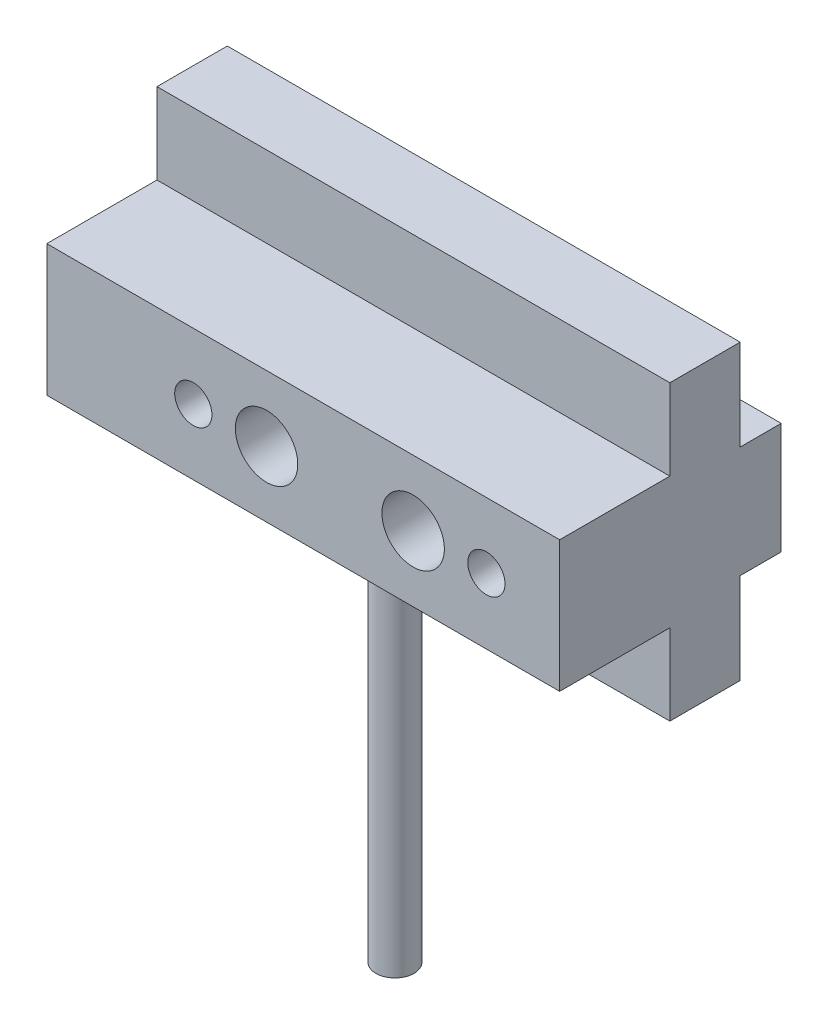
ISO-10303-21;
HEADER;
FILE_DESCRIPTION(('STEP AP214'),'2;1');
FILE_NAME('part.step','',(''),(''),'','','');
FILE_SCHEMA(('AUTOMOTIVE_DESIGN { 1 0 10303 214 1 1 1 1 }'));
ENDSEC;
DATA;
#1=APPLICATION_CONTEXT('core data for automotive mechanical design processes');
#2=APPLICATION_PROTOCOL_DEFINITION('international standard','automotive_design',2000,#1);
#3=PRODUCT_CONTEXT('',#1,'mechanical');
#4=PRODUCT('Part','Part','',(#3));
#5=PRODUCT_RELATED_PRODUCT_CATEGORY('part','',(#4));
#6=PRODUCT_DEFINITION_FORMATION('','',#4);
#7=PRODUCT_DEFINITION_CONTEXT('part definition',#1,'design');
#8=PRODUCT_DEFINITION('design','',#6,#7);
#9=PRODUCT_DEFINITION_SHAPE('','',#8);
#10=(LENGTH_UNIT() NAMED_UNIT(*) SI_UNIT(.MILLI.,.METRE.));
#11=(NAMED_UNIT(*) PLANE_ANGLE_UNIT() SI_UNIT($,.RADIAN.));
#12=(NAMED_UNIT(*) SI_UNIT($,.STERADIAN.) SOLID_ANGLE_UNIT());
#13=UNCERTAINTY_MEASURE_WITH_UNIT(LENGTH_MEASURE(1.E-05),#10,'distance_accuracy_value','');
#14=(GEOMETRIC_REPRESENTATION_CONTEXT(3) GLOBAL_UNCERTAINTY_ASSIGNED_CONTEXT((#13)) GLOBAL_UNIT_ASSIGNED_CONTEXT((#10,
#11,#12)) REPRESENTATION_CONTEXT('',''));
#15=CARTESIAN_POINT('',(0.,0.,0.));
#16=DIRECTION('',(0.,0.,1.));
#17=DIRECTION('',(1.,0.,0.));
#18=AXIS2_PLACEMENT_3D('',#15,#16,#17);
#19=CARTESIAN_POINT('',(11.1125,3.46709999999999,0.660400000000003));
#20=DIRECTION('',(0.,-1.,0.));
#21=DIRECTION('',(0.,0.,-1.));
#22=AXIS2_PLACEMENT_3D('',#19,#20,#21);
#23=PLANE('',#22);
#24=CARTESIAN_POINT('',(1.5875,3.46709999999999,3.048));
#25=DIRECTION('',(0.,-1.,0.));
#26=DIRECTION('',(0.,0.,-1.));
#27=AXIS2_PLACEMENT_3D('',#24,#25,#26);
#28=CIRCLE('',#27,0.4445);
#29=CARTESIAN_POINT('',(1.5875,3.46709999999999,2.6035));
#30=VERTEX_POINT('',#29);
#31=EDGE_CURVE('E292',#30,#30,#28,.T.);
#32=ORIENTED_EDGE('',*,*,#31,.T.);
#33=EDGE_LOOP('',(#32));
#34=FACE_BOUND('',#33,.T.);
#35=ADVANCED_FACE('F18',(#34),#23,.T.);
#36=CARTESIAN_POINT('',(1.5875,3.46709999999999,3.048));
#37=DIRECTION('',(0.,-1.,0.));
#38=DIRECTION('',(0.,0.,-1.));
#39=AXIS2_PLACEMENT_3D('',#36,#37,#38);
#40=CYLINDRICAL_SURFACE('',#39,0.4445);
#41=ORIENTED_EDGE('',*,*,#31,.F.);
#42=EDGE_LOOP('',(#41));
#43=FACE_BOUND('',#42,.T.);
#44=CARTESIAN_POINT('',(1.5875,-12.6619,3.048));
#45=DIRECTION('',(0.,-1.,0.));
#46=DIRECTION('',(0.,0.,-1.));
#47=AXIS2_PLACEMENT_3D('',#44,#45,#46);
#48=CIRCLE('',#47,0.4445);
#49=CARTESIAN_POINT('',(1.5875,-12.6619,2.6035));
#50=VERTEX_POINT('',#49);
#51=EDGE_CURVE('E150',#50,#50,#48,.T.);
#52=ORIENTED_EDGE('',*,*,#51,.T.);
#53=EDGE_LOOP('',(#52));
#54=FACE_BOUND('',#53,.T.);
#55=ADVANCED_FACE('F323',(#43,#54),#40,.F.);
#56=CARTESIAN_POINT('',(-7.30249999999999,6.43497454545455,2.81178));
#57=DIRECTION('',(1.,0.,0.));
#58=DIRECTION('',(0.,0.,-1.));
#59=AXIS2_PLACEMENT_3D('',#56,#57,#58);
#60=PLANE('',#59);
#61=CARTESIAN_POINT('',(-7.30249999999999,6.31189999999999,2.81178));
#62=DIRECTION('',(1.,0.,0.));
#63=DIRECTION('',(0.,0.,-1.));
#64=AXIS2_PLACEMENT_3D('',#61,#62,#63);
#65=CIRCLE('',#64,1.35382);
#66=CARTESIAN_POINT('',(-7.30249999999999,6.31189999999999,1.45796));
#67=VERTEX_POINT('',#66);
#68=EDGE_CURVE('E286',#67,#67,#65,.F.);
#69=ORIENTED_EDGE('',*,*,#68,.T.);
#70=EDGE_LOOP('',(#69));
#71=FACE_BOUND('',#70,.T.);
#72=ADVANCED_FACE('F327',(#71),#60,.F.);
#73=CARTESIAN_POINT('',(1.66254545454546,-12.6619,3.04800000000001));
#74=DIRECTION('',(0.,1.,0.));
#75=DIRECTION('',(0.,0.,1.));
#76=AXIS2_PLACEMENT_3D('',#73,#74,#75);
#77=PLANE('',#76);
#78=ORIENTED_EDGE('',*,*,#51,.F.);
#79=EDGE_LOOP('',(#78));
#80=FACE_BOUND('',#79,.T.);
#81=CARTESIAN_POINT('',(1.5875,-12.6619,3.048));
#82=DIRECTION('',(0.,-1.,0.));
#83=DIRECTION('',(0.,0.,-1.));
#84=AXIS2_PLACEMENT_3D('',#81,#82,#83);
#85=CIRCLE('',#84,0.8255);
#86=CARTESIAN_POINT('',(1.5875,-12.6619,2.2225));
#87=VERTEX_POINT('',#86);
#88=EDGE_CURVE('E282',#87,#87,#85,.F.);
#89=ORIENTED_EDGE('',*,*,#88,.F.);
#90=EDGE_LOOP('',(#89));
#91=FACE_BOUND('',#90,.T.);
#92=ADVANCED_FACE('F331',(#80,#91),#77,.F.);
#93=CARTESIAN_POINT('',(-4.7625,6.31189999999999,-4.8006));
#94=DIRECTION('',(-1.,0.,0.));
#95=DIRECTION('',(0.,0.,1.));
#96=AXIS2_PLACEMENT_3D('',#93,#94,#95);
#97=PLANE('',#96);
#98=DIRECTION('',(0.,1.,0.));
#99=VECTOR('',#98,1.);
#100=CARTESIAN_POINT('',(-4.7625,6.31189999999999,-5.43559999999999));
#101=LINE('',#100,#99);
#102=CARTESIAN_POINT('',(-4.7625,3.89889999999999,-5.43559999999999));
#103=VERTEX_POINT('',#102);
#104=CARTESIAN_POINT('',(-4.7625,8.72489999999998,-5.43559999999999));
#105=VERTEX_POINT('',#104);
#106=EDGE_CURVE('E140',#103,#105,#101,.T.);
#107=ORIENTED_EDGE('',*,*,#106,.T.);
#108=DIRECTION('',(0.,0.,1.));
#109=VECTOR('',#108,1.);
#110=CARTESIAN_POINT('',(-4.7625,8.72489999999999,-4.1656));
#111=LINE('',#110,#109);
#112=CARTESIAN_POINT('',(-4.7625,8.72489999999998,-4.1656));
#113=VERTEX_POINT('',#112);
#114=EDGE_CURVE('E185',#113,#105,#111,.F.);
#115=ORIENTED_EDGE('',*,*,#114,.F.);
#116=DIRECTION('',(0.,1.,0.));
#117=VECTOR('',#116,1.);
#118=CARTESIAN_POINT('',(-4.7625,3.8989,-4.1656));
#119=LINE('',#118,#117);
#120=CARTESIAN_POINT('',(-4.7625,3.8989,-4.1656));
#121=VERTEX_POINT('',#120);
#122=EDGE_CURVE('E165',#121,#113,#119,.T.);
#123=ORIENTED_EDGE('',*,*,#122,.F.);
#124=DIRECTION('',(0.,0.,-1.));
#125=VECTOR('',#124,1.);
#126=CARTESIAN_POINT('',(-4.7625,3.8989,-2.38759999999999));
#127=LINE('',#126,#125);
#128=EDGE_CURVE('E157',#103,#121,#127,.F.);
#129=ORIENTED_EDGE('',*,*,#128,.F.);
#130=EDGE_LOOP('',(#107,#115,#123,#129));
#131=FACE_BOUND('',#130,.T.);
#132=ADVANCED_FACE('F164',(#131),#97,.F.);
#133=CARTESIAN_POINT('',(-5.3975,6.31189999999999,-5.43559999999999));
#134=DIRECTION('',(0.,0.,1.));
#135=DIRECTION('',(1.,0.,0.));
#136=AXIS2_PLACEMENT_3D('',#133,#134,#135);
#137=PLANE('',#136);
#138=DIRECTION('',(1.,0.,0.));
#139=VECTOR('',#138,1.);
#140=CARTESIAN_POINT('',(11.1125,3.8989,-5.43559999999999));
#141=LINE('',#140,#139);
#142=CARTESIAN_POINT('',(-6.03249999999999,3.89889999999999,-5.43559999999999));
#143=VERTEX_POINT('',#142);
#144=EDGE_CURVE('E144',#143,#103,#141,.T.);
#145=ORIENTED_EDGE('',*,*,#144,.F.);
#146=DIRECTION('',(0.,1.,0.));
#147=VECTOR('',#146,1.);
#148=CARTESIAN_POINT('',(-6.03249999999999,6.31189999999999,-5.43559999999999));
#149=LINE('',#148,#147);
#150=CARTESIAN_POINT('',(-6.03249999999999,8.72489999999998,-5.43559999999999));
#151=VERTEX_POINT('',#150);
#152=EDGE_CURVE('E149',#143,#151,#149,.T.);
#153=ORIENTED_EDGE('',*,*,#152,.T.);
#154=DIRECTION('',(1.,0.,0.));
#155=VECTOR('',#154,1.);
#156=CARTESIAN_POINT('',(11.1125,8.72489999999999,-5.43559999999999));
#157=LINE('',#156,#155);
#158=EDGE_CURVE('E145',#105,#151,#157,.F.);
#159=ORIENTED_EDGE('',*,*,#158,.F.);
#160=ORIENTED_EDGE('',*,*,#106,.F.);
#161=EDGE_LOOP('',(#145,#153,#159,#160));
#162=FACE_BOUND('',#161,.T.);
#163=ADVANCED_FACE('F142',(#162),#137,.F.);
#164=CARTESIAN_POINT('',(-6.03249999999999,6.31189999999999,-4.8006));
#165=DIRECTION('',(1.,0.,0.));
#166=DIRECTION('',(0.,0.,-1.));
#167=AXIS2_PLACEMENT_3D('',#164,#165,#166);
#168=PLANE('',#167);
#169=ORIENTED_EDGE('',*,*,#152,.F.);
#170=DIRECTION('',(0.,0.,-1.));
#171=VECTOR('',#170,1.);
#172=CARTESIAN_POINT('',(-6.03249999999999,3.8989,-2.38759999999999));
#173=LINE('',#172,#171);
#174=CARTESIAN_POINT('',(-6.03249999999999,3.89889999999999,-4.1656));
#175=VERTEX_POINT('',#174);
#176=EDGE_CURVE('E161',#175,#143,#173,.T.);
#177=ORIENTED_EDGE('',*,*,#176,.F.);
#178=DIRECTION('',(0.,1.,0.));
#179=VECTOR('',#178,1.);
#180=CARTESIAN_POINT('',(-6.03249999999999,3.8989,-4.1656));
#181=LINE('',#180,#179);
#182=CARTESIAN_POINT('',(-6.03249999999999,8.72489999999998,-4.1656));
#183=VERTEX_POINT('',#182);
#184=EDGE_CURVE('E289',#183,#175,#181,.F.);
#185=ORIENTED_EDGE('',*,*,#184,.F.);
#186=DIRECTION('',(0.,0.,1.));
#187=VECTOR('',#186,1.);
#188=CARTESIAN_POINT('',(-6.03249999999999,8.72489999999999,-4.1656));
#189=LINE('',#188,#187);
#190=EDGE_CURVE('E182',#151,#183,#189,.T.);
#191=ORIENTED_EDGE('',*,*,#190,.F.);
#192=EDGE_LOOP('',(#169,#177,#185,#191));
#193=FACE_BOUND('',#192,.T.);
#194=ADVANCED_FACE('F340',(#193),#168,.F.);
#195=CARTESIAN_POINT('',(11.1125,3.8989,-4.1656));
#196=DIRECTION('',(0.,0.,-1.));
#197=DIRECTION('',(-1.,0.,0.));
#198=AXIS2_PLACEMENT_3D('',#195,#196,#197);
#199=PLANE('',#198);
#200=DIRECTION('',(0.,1.,0.));
#201=VECTOR('',#200,1.);
#202=CARTESIAN_POINT('',(-11.1125,6.3119,-4.1656));
#203=LINE('',#202,#201);
#204=CARTESIAN_POINT('',(-11.1125,8.72489999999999,-4.1656));
#205=VERTEX_POINT('',#204);
#206=CARTESIAN_POINT('',(-11.1125,3.8989,-4.1656));
#207=VERTEX_POINT('',#206);
#208=EDGE_CURVE('E213',#205,#207,#203,.F.);
#209=ORIENTED_EDGE('',*,*,#208,.F.);
#210=DIRECTION('',(1.,0.,0.));
#211=VECTOR('',#210,1.);
#212=CARTESIAN_POINT('',(11.1125,8.72489999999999,-4.1656));
#213=LINE('',#212,#211);
#214=EDGE_CURVE('E179',#183,#205,#213,.F.);
#215=ORIENTED_EDGE('',*,*,#214,.F.);
#216=ORIENTED_EDGE('',*,*,#184,.T.);
#217=DIRECTION('',(1.,0.,0.));
#218=VECTOR('',#217,1.);
#219=CARTESIAN_POINT('',(11.1125,3.8989,-4.1656));
#220=LINE('',#219,#218);
#221=EDGE_CURVE('E172',#207,#175,#220,.T.);
#222=ORIENTED_EDGE('',*,*,#221,.F.);
#223=EDGE_LOOP('',(#209,#215,#216,#222));
#224=FACE_BOUND('',#223,.T.);
#225=ADVANCED_FACE('F343',(#224),#199,.T.);
#226=CARTESIAN_POINT('',(-11.1125,6.31189999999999,2.81178));
#227=DIRECTION('',(1.,0.,0.));
#228=DIRECTION('',(0.,0.,-1.));
#229=AXIS2_PLACEMENT_3D('',#226,#227,#228);
#230=CYLINDRICAL_SURFACE('',#229,1.35382);
#231=CARTESIAN_POINT('',(-11.1125,6.31189999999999,2.81178));
#232=DIRECTION('',(1.,0.,0.));
#233=DIRECTION('',(0.,0.,-1.));
#234=AXIS2_PLACEMENT_3D('',#231,#232,#233);
#235=CIRCLE('',#234,1.35382);
#236=CARTESIAN_POINT('',(-11.1125,6.31189999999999,1.45796));
#237=VERTEX_POINT('',#236);
#238=EDGE_CURVE('E198',#237,#237,#235,.T.);
#239=ORIENTED_EDGE('',*,*,#238,.F.);
#240=EDGE_LOOP('',(#239));
#241=FACE_BOUND('',#240,.T.);
#242=ORIENTED_EDGE('',*,*,#68,.F.);
#243=EDGE_LOOP('',(#242));
#244=FACE_BOUND('',#243,.T.);
#245=ADVANCED_FACE('F347',(#241,#244),#230,.F.);
#246=CARTESIAN_POINT('',(1.5875,3.4671,3.048));
#247=DIRECTION('',(0.,-1.,0.));
#248=DIRECTION('',(0.,0.,-1.));
#249=AXIS2_PLACEMENT_3D('',#246,#247,#248);
#250=CYLINDRICAL_SURFACE('',#249,0.8255);
#251=CARTESIAN_POINT('',(1.5875,3.4671,3.048));
#252=DIRECTION('',(0.,-1.,0.));
#253=DIRECTION('',(0.,0.,-1.));
#254=AXIS2_PLACEMENT_3D('',#251,#252,#253);
#255=CIRCLE('',#254,0.8255);
#256=CARTESIAN_POINT('',(1.5875,3.4671,2.2225));
#257=VERTEX_POINT('',#256);
#258=EDGE_CURVE('E222',#257,#257,#255,.F.);
#259=ORIENTED_EDGE('',*,*,#258,.F.);
#260=EDGE_LOOP('',(#259));
#261=FACE_BOUND('',#260,.T.);
#262=ORIENTED_EDGE('',*,*,#88,.T.);
#263=EDGE_LOOP('',(#262));
#264=FACE_BOUND('',#263,.T.);
#265=ADVANCED_FACE('F351',(#261,#264),#250,.T.);
#266=CARTESIAN_POINT('',(11.1125,12.6619,0.660400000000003));
#267=DIRECTION('',(0.,0.,1.));
#268=DIRECTION('',(1.,0.,0.));
#269=AXIS2_PLACEMENT_3D('',#266,#267,#268);
#270=PLANE('',#269);
#271=DIRECTION('',(0.,1.,0.));
#272=VECTOR('',#271,1.);
#273=CARTESIAN_POINT('',(11.1125,9.1567,0.660400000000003));
#274=LINE('',#273,#272);
#275=CARTESIAN_POINT('',(11.1125,3.46709999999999,0.660400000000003));
#276=VERTEX_POINT('',#275);
#277=CARTESIAN_POINT('',(11.1125,-0.0381000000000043,0.660400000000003));
#278=VERTEX_POINT('',#277);
#279=EDGE_CURVE('E241',#276,#278,#274,.F.);
#280=ORIENTED_EDGE('',*,*,#279,.F.);
#281=DIRECTION('',(1.,0.,0.));
#282=VECTOR('',#281,1.);
#283=CARTESIAN_POINT('',(11.1125,3.46709999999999,0.660400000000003));
#284=LINE('',#283,#282);
#285=CARTESIAN_POINT('',(-11.1125,3.46709999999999,0.660400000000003));
#286=VERTEX_POINT('',#285);
#287=EDGE_CURVE('E220',#286,#276,#284,.T.);
#288=ORIENTED_EDGE('',*,*,#287,.F.);
#289=DIRECTION('',(0.,1.,0.));
#290=VECTOR('',#289,1.);
#291=CARTESIAN_POINT('',(-11.1125,6.3119,0.660400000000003));
#292=LINE('',#291,#290);
#293=CARTESIAN_POINT('',(-11.1125,-0.038100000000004,0.660400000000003));
#294=VERTEX_POINT('',#293);
#295=EDGE_CURVE('E202',#294,#286,#292,.T.);
#296=ORIENTED_EDGE('',*,*,#295,.F.);
#297=DIRECTION('',(1.,0.,0.));
#298=VECTOR('',#297,1.);
#299=CARTESIAN_POINT('',(11.1125,-0.038100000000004,0.660400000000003));
#300=LINE('',#299,#298);
#301=EDGE_CURVE('E285',#278,#294,#300,.F.);
#302=ORIENTED_EDGE('',*,*,#301,.F.);
#303=EDGE_LOOP('',(#280,#288,#296,#302));
#304=FACE_BOUND('',#303,.T.);
#305=ADVANCED_FACE('F355',(#304),#270,.T.);
#306=CARTESIAN_POINT('',(11.1125,-0.038100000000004,0.660400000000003));
#307=DIRECTION('',(0.,-1.,0.));
#308=DIRECTION('',(0.,0.,-1.));
#309=AXIS2_PLACEMENT_3D('',#306,#307,#308);
#310=PLANE('',#309);
#311=DIRECTION('',(0.,0.,-1.));
#312=VECTOR('',#311,1.);
#313=CARTESIAN_POINT('',(11.1125,-0.0381000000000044,0.660400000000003));
#314=LINE('',#313,#312);
#315=CARTESIAN_POINT('',(11.1125,-0.0381000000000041,-2.38759999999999));
#316=VERTEX_POINT('',#315);
#317=EDGE_CURVE('E239',#278,#316,#314,.T.);
#318=ORIENTED_EDGE('',*,*,#317,.F.);
#319=ORIENTED_EDGE('',*,*,#301,.T.);
#320=DIRECTION('',(0.,0.,1.));
#321=VECTOR('',#320,1.);
#322=CARTESIAN_POINT('',(-11.1125,-0.0381000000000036,0.198339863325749));
#323=LINE('',#322,#321);
#324=CARTESIAN_POINT('',(-11.1125,-0.0381000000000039,-2.38759999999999));
#325=VERTEX_POINT('',#324);
#326=EDGE_CURVE('E204',#325,#294,#323,.T.);
#327=ORIENTED_EDGE('',*,*,#326,.F.);
#328=DIRECTION('',(-1.,0.,0.));
#329=VECTOR('',#328,1.);
#330=CARTESIAN_POINT('',(11.1125,-0.038100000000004,-2.38759999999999));
#331=LINE('',#330,#329);
#332=EDGE_CURVE('E174',#316,#325,#331,.T.);
#333=ORIENTED_EDGE('',*,*,#332,.F.);
#334=EDGE_LOOP('',(#318,#319,#327,#333));
#335=FACE_BOUND('',#334,.T.);
#336=ADVANCED_FACE('F359',(#335),#310,.T.);
#337=CARTESIAN_POINT('',(11.1125,-0.038100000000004,-2.38759999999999));
#338=DIRECTION('',(0.,0.,-1.));
#339=DIRECTION('',(-1.,0.,0.));
#340=AXIS2_PLACEMENT_3D('',#337,#338,#339);
#341=PLANE('',#340);
#342=DIRECTION('',(0.,1.,0.));
#343=VECTOR('',#342,1.);
#344=CARTESIAN_POINT('',(11.1125,9.1567,-2.38759999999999));
#345=LINE('',#344,#343);
#346=CARTESIAN_POINT('',(11.1125,3.89889999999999,-2.38759999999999));
#347=VERTEX_POINT('',#346);
#348=EDGE_CURVE('E237',#316,#347,#345,.T.);
#349=ORIENTED_EDGE('',*,*,#348,.F.);
#350=ORIENTED_EDGE('',*,*,#332,.T.);
#351=DIRECTION('',(0.,1.,0.));
#352=VECTOR('',#351,1.);
#353=CARTESIAN_POINT('',(-11.1125,6.3119,-2.38759999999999));
#354=LINE('',#353,#352);
#355=CARTESIAN_POINT('',(-11.1125,3.89889999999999,-2.38759999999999));
#356=VERTEX_POINT('',#355);
#357=EDGE_CURVE('E207',#356,#325,#354,.F.);
#358=ORIENTED_EDGE('',*,*,#357,.F.);
#359=DIRECTION('',(1.,0.,0.));
#360=VECTOR('',#359,1.);
#361=CARTESIAN_POINT('',(11.1125,3.8989,-2.38759999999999));
#362=LINE('',#361,#360);
#363=EDGE_CURVE('E166',#347,#356,#362,.F.);
#364=ORIENTED_EDGE('',*,*,#363,.F.);
#365=EDGE_LOOP('',(#349,#350,#358,#364));
#366=FACE_BOUND('',#365,.T.);
#367=ADVANCED_FACE('F363',(#366),#341,.T.);
#368=CARTESIAN_POINT('',(11.1125,3.8989,-2.38759999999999));
#369=DIRECTION('',(0.,-1.,0.));
#370=DIRECTION('',(0.,0.,-1.));
#371=AXIS2_PLACEMENT_3D('',#368,#369,#370);
#372=PLANE('',#371);
#373=DIRECTION('',(0.,0.,-1.));
#374=VECTOR('',#373,1.);
#375=CARTESIAN_POINT('',(11.1125,3.8989,0.660400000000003));
#376=LINE('',#375,#374);
#377=CARTESIAN_POINT('',(11.1125,3.8989,-4.1656));
#378=VERTEX_POINT('',#377);
#379=EDGE_CURVE('E235',#347,#378,#376,.T.);
#380=ORIENTED_EDGE('',*,*,#379,.F.);
#381=ORIENTED_EDGE('',*,*,#363,.T.);
#382=DIRECTION('',(0.,0.,1.));
#383=VECTOR('',#382,1.);
#384=CARTESIAN_POINT('',(-11.1125,3.8989,0.198339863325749));
#385=LINE('',#384,#383);
#386=EDGE_CURVE('E210',#207,#356,#385,.T.);
#387=ORIENTED_EDGE('',*,*,#386,.F.);
#388=ORIENTED_EDGE('',*,*,#221,.T.);
#389=ORIENTED_EDGE('',*,*,#176,.T.);
#390=ORIENTED_EDGE('',*,*,#144,.T.);
#391=ORIENTED_EDGE('',*,*,#128,.T.);
#392=DIRECTION('',(-1.,0.,0.));
#393=VECTOR('',#392,1.);
#394=CARTESIAN_POINT('',(11.1125,3.8989,-4.1656));
#395=LINE('',#394,#393);
#396=EDGE_CURVE('E175',#378,#121,#395,.T.);
#397=ORIENTED_EDGE('',*,*,#396,.F.);
#398=EDGE_LOOP('',(#380,#381,#387,#388,#389,#390,#391,#397));
#399=FACE_BOUND('',#398,.T.);
#400=ADVANCED_FACE('F155',(#399),#372,.T.);
#401=CARTESIAN_POINT('',(11.1125,3.8989,-4.1656));
#402=DIRECTION('',(0.,0.,-1.));
#403=DIRECTION('',(-1.,0.,0.));
#404=AXIS2_PLACEMENT_3D('',#401,#402,#403);
#405=PLANE('',#404);
#406=DIRECTION('',(0.,1.,0.));
#407=VECTOR('',#406,1.);
#408=CARTESIAN_POINT('',(11.1125,9.1567,-4.1656));
#409=LINE('',#408,#407);
#410=CARTESIAN_POINT('',(11.1125,8.72489999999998,-4.1656));
#411=VERTEX_POINT('',#410);
#412=EDGE_CURVE('E233',#378,#411,#409,.T.);
#413=ORIENTED_EDGE('',*,*,#412,.F.);
#414=ORIENTED_EDGE('',*,*,#396,.T.);
#415=ORIENTED_EDGE('',*,*,#122,.T.);
#416=DIRECTION('',(1.,0.,0.));
#417=VECTOR('',#416,1.);
#418=CARTESIAN_POINT('',(11.1125,8.72489999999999,-4.1656));
#419=LINE('',#418,#417);
#420=EDGE_CURVE('E177',#411,#113,#419,.F.);
#421=ORIENTED_EDGE('',*,*,#420,.F.);
#422=EDGE_LOOP('',(#413,#414,#415,#421));
#423=FACE_BOUND('',#422,.T.);
#424=ADVANCED_FACE('F370',(#423),#405,.T.);
#425=CARTESIAN_POINT('',(11.1125,8.72489999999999,-4.1656));
#426=DIRECTION('',(0.,1.,0.));
#427=DIRECTION('',(0.,0.,1.));
#428=AXIS2_PLACEMENT_3D('',#425,#426,#427);
#429=PLANE('',#428);
#430=ORIENTED_EDGE('',*,*,#190,.T.);
#431=ORIENTED_EDGE('',*,*,#214,.T.);
#432=DIRECTION('',(0.,0.,1.));
#433=VECTOR('',#432,1.);
#434=CARTESIAN_POINT('',(-11.1125,8.72489999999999,0.198339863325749));
#435=LINE('',#434,#433);
#436=CARTESIAN_POINT('',(-11.1125,8.72489999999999,-2.38759999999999));
#437=VERTEX_POINT('',#436);
#438=EDGE_CURVE('E215',#437,#205,#435,.F.);
#439=ORIENTED_EDGE('',*,*,#438,.F.);
#440=DIRECTION('',(-1.,0.,0.));
#441=VECTOR('',#440,1.);
#442=CARTESIAN_POINT('',(11.1125,8.72489999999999,-2.38759999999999));
#443=LINE('',#442,#441);
#444=CARTESIAN_POINT('',(11.1125,8.72489999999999,-2.38759999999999));
#445=VERTEX_POINT('',#444);
#446=EDGE_CURVE('E181',#445,#437,#443,.T.);
#447=ORIENTED_EDGE('',*,*,#446,.F.);
#448=DIRECTION('',(0.,0.,-1.));
#449=VECTOR('',#448,1.);
#450=CARTESIAN_POINT('',(11.1125,8.72489999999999,0.660400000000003));
#451=LINE('',#450,#449);
#452=EDGE_CURVE('E231',#411,#445,#451,.F.);
#453=ORIENTED_EDGE('',*,*,#452,.F.);
#454=ORIENTED_EDGE('',*,*,#420,.T.);
#455=ORIENTED_EDGE('',*,*,#114,.T.);
#456=ORIENTED_EDGE('',*,*,#158,.T.);
#457=EDGE_LOOP('',(#430,#431,#439,#447,#453,#454,#455,#456));
#458=FACE_BOUND('',#457,.T.);
#459=ADVANCED_FACE('F373',(#458),#429,.T.);
#460=CARTESIAN_POINT('',(11.1125,8.72489999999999,-2.38759999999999));
#461=DIRECTION('',(0.,0.,-1.));
#462=DIRECTION('',(-1.,0.,0.));
#463=AXIS2_PLACEMENT_3D('',#460,#461,#462);
#464=PLANE('',#463);
#465=DIRECTION('',(0.,1.,0.));
#466=VECTOR('',#465,1.);
#467=CARTESIAN_POINT('',(11.1125,9.1567,-2.38759999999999));
#468=LINE('',#467,#466);
#469=CARTESIAN_POINT('',(11.1125,12.6619,-2.38759999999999));
#470=VERTEX_POINT('',#469);
#471=EDGE_CURVE('E229',#445,#470,#468,.T.);
#472=ORIENTED_EDGE('',*,*,#471,.F.);
#473=ORIENTED_EDGE('',*,*,#446,.T.);
#474=DIRECTION('',(0.,1.,0.));
#475=VECTOR('',#474,1.);
#476=CARTESIAN_POINT('',(-11.1125,6.3119,-2.38759999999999));
#477=LINE('',#476,#475);
#478=CARTESIAN_POINT('',(-11.1125,12.6619,-2.38759999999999));
#479=VERTEX_POINT('',#478);
#480=EDGE_CURVE('E194',#479,#437,#477,.F.);
#481=ORIENTED_EDGE('',*,*,#480,.F.);
#482=DIRECTION('',(1.,0.,0.));
#483=VECTOR('',#482,1.);
#484=CARTESIAN_POINT('',(11.1125,12.6619,-2.38759999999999));
#485=LINE('',#484,#483);
#486=EDGE_CURVE('E190',#470,#479,#485,.F.);
#487=ORIENTED_EDGE('',*,*,#486,.F.);
#488=EDGE_LOOP('',(#472,#473,#481,#487));
#489=FACE_BOUND('',#488,.T.);
#490=ADVANCED_FACE('F377',(#489),#464,.T.);
#491=CARTESIAN_POINT('',(11.1125,12.6619,-2.38759999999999));
#492=DIRECTION('',(0.,1.,0.));
#493=DIRECTION('',(0.,0.,1.));
#494=AXIS2_PLACEMENT_3D('',#491,#492,#493);
#495=PLANE('',#494);
#496=DIRECTION('',(0.,0.,-1.));
#497=VECTOR('',#496,1.);
#498=CARTESIAN_POINT('',(11.1125,12.6619,0.660400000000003));
#499=LINE('',#498,#497);
#500=CARTESIAN_POINT('',(11.1125,12.6619,0.660400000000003));
#501=VERTEX_POINT('',#500);
#502=EDGE_CURVE('E227',#470,#501,#499,.F.);
#503=ORIENTED_EDGE('',*,*,#502,.F.);
#504=ORIENTED_EDGE('',*,*,#486,.T.);
#505=DIRECTION('',(0.,0.,1.));
#506=VECTOR('',#505,1.);
#507=CARTESIAN_POINT('',(-11.1125,12.6619,0.198339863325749));
#508=LINE('',#507,#506);
#509=CARTESIAN_POINT('',(-11.1125,12.6619,0.660400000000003));
#510=VERTEX_POINT('',#509);
#511=EDGE_CURVE('E195',#510,#479,#508,.F.);
#512=ORIENTED_EDGE('',*,*,#511,.F.);
#513=DIRECTION('',(1.,0.,0.));
#514=VECTOR('',#513,1.);
#515=CARTESIAN_POINT('',(11.1125,12.6619,0.660400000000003));
#516=LINE('',#515,#514);
#517=EDGE_CURVE('E192',#501,#510,#516,.F.);
#518=ORIENTED_EDGE('',*,*,#517,.F.);
#519=EDGE_LOOP('',(#503,#504,#512,#518));
#520=FACE_BOUND('',#519,.T.);
#521=ADVANCED_FACE('F381',(#520),#495,.T.);
#522=CARTESIAN_POINT('',(11.1125,12.6619,0.660400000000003));
#523=DIRECTION('',(0.,0.,1.));
#524=DIRECTION('',(1.,0.,0.));
#525=AXIS2_PLACEMENT_3D('',#522,#523,#524);
#526=PLANE('',#525);
#527=DIRECTION('',(0.,1.,0.));
#528=VECTOR('',#527,1.);
#529=CARTESIAN_POINT('',(11.1125,9.1567,0.660400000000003));
#530=LINE('',#529,#528);
#531=CARTESIAN_POINT('',(11.1125,9.1567,0.660400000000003));
#532=VERTEX_POINT('',#531);
#533=EDGE_CURVE('E56',#501,#532,#530,.F.);
#534=ORIENTED_EDGE('',*,*,#533,.F.);
#535=ORIENTED_EDGE('',*,*,#517,.T.);
#536=DIRECTION('',(0.,1.,0.));
#537=VECTOR('',#536,1.);
#538=CARTESIAN_POINT('',(-11.1125,6.3119,0.660400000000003));
#539=LINE('',#538,#537);
#540=CARTESIAN_POINT('',(-11.1125,9.15669999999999,0.660400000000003));
#541=VERTEX_POINT('',#540);
#542=EDGE_CURVE('E199',#541,#510,#539,.T.);
#543=ORIENTED_EDGE('',*,*,#542,.F.);
#544=DIRECTION('',(1.,0.,0.));
#545=VECTOR('',#544,1.);
#546=CARTESIAN_POINT('',(-11.2395,9.1567,0.660400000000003));
#547=LINE('',#546,#545);
#548=EDGE_CURVE('E246',#532,#541,#547,.F.);
#549=ORIENTED_EDGE('',*,*,#548,.F.);
#550=EDGE_LOOP('',(#534,#535,#543,#549));
#551=FACE_BOUND('',#550,.T.);
#552=ADVANCED_FACE('F385',(#551),#526,.T.);
#553=CARTESIAN_POINT('',(-4.83581363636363,6.3119,2.1336));
#554=DIRECTION('',(0.,0.,1.));
#555=DIRECTION('',(1.,0.,0.));
#556=AXIS2_PLACEMENT_3D('',#553,#554,#555);
#557=PLANE('',#556);
#558=CARTESIAN_POINT('',(-4.7625,6.3119,2.1336));
#559=DIRECTION('',(0.,0.,1.));
#560=DIRECTION('',(1.,0.,0.));
#561=AXIS2_PLACEMENT_3D('',#558,#559,#560);
#562=CIRCLE('',#561,0.80645);
#563=CARTESIAN_POINT('',(-3.95605,6.3119,2.1336));
#564=VERTEX_POINT('',#563);
#565=EDGE_CURVE('E248',#564,#564,#562,.T.);
#566=ORIENTED_EDGE('',*,*,#565,.T.);
#567=EDGE_LOOP('',(#566));
#568=FACE_BOUND('',#567,.T.);
#569=ADVANCED_FACE('F389',(#568),#557,.T.);
#570=CARTESIAN_POINT('',(-1.71045909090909,6.3119,0.863599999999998));
#571=DIRECTION('',(0.,0.,1.));
#572=DIRECTION('',(1.,0.,0.));
#573=AXIS2_PLACEMENT_3D('',#570,#571,#572);
#574=PLANE('',#573);
#575=CARTESIAN_POINT('',(-1.5875,6.3119,0.863599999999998));
#576=DIRECTION('',(0.,0.,-1.));
#577=DIRECTION('',(-1.,0.,0.));
#578=AXIS2_PLACEMENT_3D('',#575,#576,#577);
#579=CIRCLE('',#578,1.35255);
#580=CARTESIAN_POINT('',(-2.94005,6.3119,0.863599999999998));
#581=VERTEX_POINT('',#580);
#582=EDGE_CURVE('E273',#581,#581,#579,.F.);
#583=ORIENTED_EDGE('',*,*,#582,.T.);
#584=EDGE_LOOP('',(#583));
#585=FACE_BOUND('',#584,.T.);
#586=ADVANCED_FACE('F393',(#585),#574,.T.);
#587=CARTESIAN_POINT('',(4.6395409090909,6.3119,0.863599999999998));
#588=DIRECTION('',(0.,0.,1.));
#589=DIRECTION('',(1.,0.,0.));
#590=AXIS2_PLACEMENT_3D('',#587,#588,#589);
#591=PLANE('',#590);
#592=CARTESIAN_POINT('',(4.7625,6.3119,0.863599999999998));
#593=DIRECTION('',(0.,0.,-1.));
#594=DIRECTION('',(-1.,0.,0.));
#595=AXIS2_PLACEMENT_3D('',#592,#593,#594);
#596=CIRCLE('',#595,1.35255);
#597=CARTESIAN_POINT('',(3.40995,6.3119,0.863599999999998));
#598=VERTEX_POINT('',#597);
#599=EDGE_CURVE('E259',#598,#598,#596,.F.);
#600=ORIENTED_EDGE('',*,*,#599,.T.);
#601=EDGE_LOOP('',(#600));
#602=FACE_BOUND('',#601,.T.);
#603=ADVANCED_FACE('F397',(#602),#591,.T.);
#604=CARTESIAN_POINT('',(-11.1125,6.3119,0.198339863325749));
#605=DIRECTION('',(-1.,0.,0.));
#606=DIRECTION('',(0.,0.,1.));
#607=AXIS2_PLACEMENT_3D('',#604,#605,#606);
#608=PLANE('',#607);
#609=ORIENTED_EDGE('',*,*,#238,.T.);
#610=EDGE_LOOP('',(#609));
#611=FACE_BOUND('',#610,.T.);
#612=ORIENTED_EDGE('',*,*,#542,.T.);
#613=ORIENTED_EDGE('',*,*,#511,.T.);
#614=ORIENTED_EDGE('',*,*,#480,.T.);
#615=ORIENTED_EDGE('',*,*,#438,.T.);
#616=ORIENTED_EDGE('',*,*,#208,.T.);
#617=ORIENTED_EDGE('',*,*,#386,.T.);
#618=ORIENTED_EDGE('',*,*,#357,.T.);
#619=ORIENTED_EDGE('',*,*,#326,.T.);
#620=ORIENTED_EDGE('',*,*,#295,.T.);
#621=DIRECTION('',(0.,0.,-1.));
#622=VECTOR('',#621,1.);
#623=CARTESIAN_POINT('',(-11.1125,3.46709999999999,0.660400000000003));
#624=LINE('',#623,#622);
#625=CARTESIAN_POINT('',(-11.1125,3.46709999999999,5.4356));
#626=VERTEX_POINT('',#625);
#627=EDGE_CURVE('E223',#626,#286,#624,.T.);
#628=ORIENTED_EDGE('',*,*,#627,.F.);
#629=DIRECTION('',(0.,1.,0.));
#630=VECTOR('',#629,1.);
#631=CARTESIAN_POINT('',(-11.1125,6.3119,5.4356));
#632=LINE('',#631,#630);
#633=CARTESIAN_POINT('',(-11.1125,9.15669999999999,5.4356));
#634=VERTEX_POINT('',#633);
#635=EDGE_CURVE('E258',#634,#626,#632,.F.);
#636=ORIENTED_EDGE('',*,*,#635,.F.);
#637=DIRECTION('',(0.,0.,1.));
#638=VECTOR('',#637,1.);
#639=CARTESIAN_POINT('',(-11.1125,9.1567,0.660400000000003));
#640=LINE('',#639,#638);
#641=EDGE_CURVE('E50',#541,#634,#640,.T.);
#642=ORIENTED_EDGE('',*,*,#641,.F.);
#643=EDGE_LOOP('',(#612,#613,#614,#615,#616,#617,#618,#619,#620,#628,#636,#642));
#644=FACE_BOUND('',#643,.T.);
#645=ADVANCED_FACE('F401',(#611,#644),#608,.T.);
#646=CARTESIAN_POINT('',(11.1125,3.46709999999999,0.660400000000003));
#647=DIRECTION('',(0.,-1.,0.));
#648=DIRECTION('',(0.,0.,-1.));
#649=AXIS2_PLACEMENT_3D('',#646,#647,#648);
#650=PLANE('',#649);
#651=ORIENTED_EDGE('',*,*,#258,.T.);
#652=EDGE_LOOP('',(#651));
#653=FACE_BOUND('',#652,.T.);
#654=DIRECTION('',(0.,0.,-1.));
#655=VECTOR('',#654,1.);
#656=CARTESIAN_POINT('',(11.1125,3.46709999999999,0.660400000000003));
#657=LINE('',#656,#655);
#658=CARTESIAN_POINT('',(11.1125,3.46709999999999,5.4356));
#659=VERTEX_POINT('',#658);
#660=EDGE_CURVE('E243',#659,#276,#657,.T.);
#661=ORIENTED_EDGE('',*,*,#660,.F.);
#662=DIRECTION('',(1.,0.,0.));
#663=VECTOR('',#662,1.);
#664=CARTESIAN_POINT('',(-0.063499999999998,3.46709999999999,5.4356));
#665=LINE('',#664,#663);
#666=EDGE_CURVE('E256',#626,#659,#665,.T.);
#667=ORIENTED_EDGE('',*,*,#666,.F.);
#668=ORIENTED_EDGE('',*,*,#627,.T.);
#669=ORIENTED_EDGE('',*,*,#287,.T.);
#670=EDGE_LOOP('',(#661,#667,#668,#669));
#671=FACE_BOUND('',#670,.T.);
#672=ADVANCED_FACE('F405',(#653,#671),#650,.T.);
#673=CARTESIAN_POINT('',(11.1125,9.1567,0.660400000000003));
#674=DIRECTION('',(1.,0.,0.));
#675=DIRECTION('',(0.,0.,-1.));
#676=AXIS2_PLACEMENT_3D('',#673,#674,#675);
#677=PLANE('',#676);
#678=ORIENTED_EDGE('',*,*,#533,.T.);
#679=DIRECTION('',(0.,0.,1.));
#680=VECTOR('',#679,1.);
#681=CARTESIAN_POINT('',(11.1125,9.1567,0.660400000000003));
#682=LINE('',#681,#680);
#683=CARTESIAN_POINT('',(11.1125,9.1567,5.4356));
#684=VERTEX_POINT('',#683);
#685=EDGE_CURVE('E249',#684,#532,#682,.F.);
#686=ORIENTED_EDGE('',*,*,#685,.F.);
#687=DIRECTION('',(0.,1.,0.));
#688=VECTOR('',#687,1.);
#689=CARTESIAN_POINT('',(11.1125,6.3119,5.4356));
#690=LINE('',#689,#688);
#691=EDGE_CURVE('E37',#659,#684,#690,.T.);
#692=ORIENTED_EDGE('',*,*,#691,.F.);
#693=ORIENTED_EDGE('',*,*,#660,.T.);
#694=ORIENTED_EDGE('',*,*,#279,.T.);
#695=ORIENTED_EDGE('',*,*,#317,.T.);
#696=ORIENTED_EDGE('',*,*,#348,.T.);
#697=ORIENTED_EDGE('',*,*,#379,.T.);
#698=ORIENTED_EDGE('',*,*,#412,.T.);
#699=ORIENTED_EDGE('',*,*,#452,.T.);
#700=ORIENTED_EDGE('',*,*,#471,.T.);
#701=ORIENTED_EDGE('',*,*,#502,.T.);
#702=EDGE_LOOP('',(#678,#686,#692,#693,#694,#695,#696,#697,#698,#699,#700,#701));
#703=FACE_BOUND('',#702,.T.);
#704=ADVANCED_FACE('F409',(#703),#677,.T.);
#705=CARTESIAN_POINT('',(-11.2395,9.1567,0.660400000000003));
#706=DIRECTION('',(0.,1.,0.));
#707=DIRECTION('',(0.,0.,1.));
#708=AXIS2_PLACEMENT_3D('',#705,#706,#707);
#709=PLANE('',#708);
#710=ORIENTED_EDGE('',*,*,#685,.T.);
#711=ORIENTED_EDGE('',*,*,#548,.T.);
#712=ORIENTED_EDGE('',*,*,#641,.T.);
#713=DIRECTION('',(1.,0.,0.));
#714=VECTOR('',#713,1.);
#715=CARTESIAN_POINT('',(-0.063499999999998,9.1567,5.4356));
#716=LINE('',#715,#714);
#717=EDGE_CURVE('E252',#684,#634,#716,.F.);
#718=ORIENTED_EDGE('',*,*,#717,.F.);
#719=EDGE_LOOP('',(#710,#711,#712,#718));
#720=FACE_BOUND('',#719,.T.);
#721=ADVANCED_FACE('F413',(#720),#709,.T.);
#722=CARTESIAN_POINT('',(-4.7625,6.3119,2.1336));
#723=DIRECTION('',(0.,0.,1.));
#724=DIRECTION('',(1.,0.,0.));
#725=AXIS2_PLACEMENT_3D('',#722,#723,#724);
#726=CYLINDRICAL_SURFACE('',#725,0.80645);
#727=CARTESIAN_POINT('',(-4.7625,6.3119,5.4356));
#728=DIRECTION('',(0.,0.,1.));
#729=DIRECTION('',(1.,0.,0.));
#730=AXIS2_PLACEMENT_3D('',#727,#728,#729);
#731=CIRCLE('',#730,0.80645);
#732=CARTESIAN_POINT('',(-3.95605,6.3119,5.4356));
#733=VERTEX_POINT('',#732);
#734=EDGE_CURVE('E254',#733,#733,#731,.F.);
#735=ORIENTED_EDGE('',*,*,#734,.F.);
#736=EDGE_LOOP('',(#735));
#737=FACE_BOUND('',#736,.T.);
#738=ORIENTED_EDGE('',*,*,#565,.F.);
#739=EDGE_LOOP('',(#738));
#740=FACE_BOUND('',#739,.T.);
#741=ADVANCED_FACE('F416',(#737,#740),#726,.F.);
#742=CARTESIAN_POINT('',(-1.5875,6.3119,5.4356));
#743=DIRECTION('',(0.,0.,-1.));
#744=DIRECTION('',(-1.,0.,0.));
#745=AXIS2_PLACEMENT_3D('',#742,#743,#744);
#746=CYLINDRICAL_SURFACE('',#745,1.35255);
#747=CARTESIAN_POINT('',(-1.5875,6.3119,5.4356));
#748=DIRECTION('',(0.,0.,-1.));
#749=DIRECTION('',(-1.,0.,0.));
#750=AXIS2_PLACEMENT_3D('',#747,#748,#749);
#751=CIRCLE('',#750,1.35255);
#752=CARTESIAN_POINT('',(-2.94005,6.3119,5.4356));
#753=VERTEX_POINT('',#752);
#754=EDGE_CURVE('E266',#753,#753,#751,.T.);
#755=ORIENTED_EDGE('',*,*,#754,.F.);
#756=EDGE_LOOP('',(#755));
#757=FACE_BOUND('',#756,.T.);
#758=ORIENTED_EDGE('',*,*,#582,.F.);
#759=EDGE_LOOP('',(#758));
#760=FACE_BOUND('',#759,.T.);
#761=ADVANCED_FACE('F419',(#757,#760),#746,.F.);
#762=CARTESIAN_POINT('',(4.7625,6.3119,5.4356));
#763=DIRECTION('',(0.,0.,-1.));
#764=DIRECTION('',(-1.,0.,0.));
#765=AXIS2_PLACEMENT_3D('',#762,#763,#764);
#766=CYLINDRICAL_SURFACE('',#765,1.35255);
#767=CARTESIAN_POINT('',(4.7625,6.3119,5.4356));
#768=DIRECTION('',(0.,0.,-1.));
#769=DIRECTION('',(-1.,0.,0.));
#770=AXIS2_PLACEMENT_3D('',#767,#768,#769);
#771=CIRCLE('',#770,1.35255);
#772=CARTESIAN_POINT('',(3.40995,6.3119,5.4356));
#773=VERTEX_POINT('',#772);
#774=EDGE_CURVE('E263',#773,#773,#771,.T.);
#775=ORIENTED_EDGE('',*,*,#774,.F.);
#776=EDGE_LOOP('',(#775));
#777=FACE_BOUND('',#776,.T.);
#778=ORIENTED_EDGE('',*,*,#599,.F.);
#779=EDGE_LOOP('',(#778));
#780=FACE_BOUND('',#779,.T.);
#781=ADVANCED_FACE('F423',(#777,#780),#766,.F.);
#782=CARTESIAN_POINT('',(7.86418636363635,6.3119,2.1336));
#783=DIRECTION('',(0.,0.,1.));
#784=DIRECTION('',(1.,0.,0.));
#785=AXIS2_PLACEMENT_3D('',#782,#783,#784);
#786=PLANE('',#785);
#787=CARTESIAN_POINT('',(7.93749999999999,6.3119,2.1336));
#788=DIRECTION('',(0.,0.,1.));
#789=DIRECTION('',(1.,0.,0.));
#790=AXIS2_PLACEMENT_3D('',#787,#788,#789);
#791=CIRCLE('',#790,0.80645);
#792=CARTESIAN_POINT('',(8.74394999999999,6.3119,2.1336));
#793=VERTEX_POINT('',#792);
#794=EDGE_CURVE('E28',#793,#793,#791,.T.);
#795=ORIENTED_EDGE('',*,*,#794,.T.);
#796=EDGE_LOOP('',(#795));
#797=FACE_BOUND('',#796,.T.);
#798=ADVANCED_FACE('F427',(#797),#786,.T.);
#799=CARTESIAN_POINT('',(-0.063499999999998,6.3119,5.4356));
#800=DIRECTION('',(0.,0.,1.));
#801=DIRECTION('',(1.,0.,0.));
#802=AXIS2_PLACEMENT_3D('',#799,#800,#801);
#803=PLANE('',#802);
#804=CARTESIAN_POINT('',(7.93749999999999,6.3119,5.4356));
#805=DIRECTION('',(0.,0.,1.));
#806=DIRECTION('',(1.,0.,0.));
#807=AXIS2_PLACEMENT_3D('',#804,#805,#806);
#808=CIRCLE('',#807,0.80645);
#809=CARTESIAN_POINT('',(8.74394999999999,6.3119,5.4356));
#810=VERTEX_POINT('',#809);
#811=EDGE_CURVE('E11',#810,#810,#808,.F.);
#812=ORIENTED_EDGE('',*,*,#811,.T.);
#813=EDGE_LOOP('',(#812));
#814=FACE_BOUND('',#813,.T.);
#815=ORIENTED_EDGE('',*,*,#774,.T.);
#816=EDGE_LOOP('',(#815));
#817=FACE_BOUND('',#816,.T.);
#818=ORIENTED_EDGE('',*,*,#754,.T.);
#819=EDGE_LOOP('',(#818));
#820=FACE_BOUND('',#819,.T.);
#821=ORIENTED_EDGE('',*,*,#734,.T.);
#822=EDGE_LOOP('',(#821));
#823=FACE_BOUND('',#822,.T.);
#824=ORIENTED_EDGE('',*,*,#691,.T.);
#825=ORIENTED_EDGE('',*,*,#717,.T.);
#826=ORIENTED_EDGE('',*,*,#635,.T.);
#827=ORIENTED_EDGE('',*,*,#666,.T.);
#828=EDGE_LOOP('',(#824,#825,#826,#827));
#829=FACE_BOUND('',#828,.T.);
#830=ADVANCED_FACE('F430',(#814,#817,#820,#823,#829),#803,.T.);
#831=CARTESIAN_POINT('',(7.93749999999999,6.3119,2.1336));
#832=DIRECTION('',(0.,0.,1.));
#833=DIRECTION('',(1.,0.,0.));
#834=AXIS2_PLACEMENT_3D('',#831,#832,#833);
#835=CYLINDRICAL_SURFACE('',#834,0.80645);
#836=ORIENTED_EDGE('',*,*,#811,.F.);
#837=EDGE_LOOP('',(#836));
#838=FACE_BOUND('',#837,.T.);
#839=ORIENTED_EDGE('',*,*,#794,.F.);
#840=EDGE_LOOP('',(#839));
#841=FACE_BOUND('',#840,.T.);
#842=ADVANCED_FACE('F20',(#838,#841),#835,.F.);
#843=CLOSED_SHELL('',(#35,#55,#72,#92,#132,#163,#194,#225,#245,#265,#305,#336,#367,#400,#424,
#459,#490,#521,#552,#569,#586,#603,#645,#672,#704,#721,#741,#761,#781,#798,#830,#842));
#844=CARTESIAN_POINT('',(-7.30249999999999,6.38521363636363,-0.364490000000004));
#845=DIRECTION('',(1.,0.,0.));
#846=DIRECTION('',(0.,0.,-1.));
#847=AXIS2_PLACEMENT_3D('',#844,#845,#846);
#848=PLANE('',#847);
#849=CARTESIAN_POINT('',(-7.30249999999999,6.31189999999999,-0.364490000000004));
#850=DIRECTION('',(1.,0.,0.));
#851=DIRECTION('',(0.,0.,-1.));
#852=AXIS2_PLACEMENT_3D('',#849,#850,#851);
#853=CIRCLE('',#852,0.80645);
#854=CARTESIAN_POINT('',(-7.30249999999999,6.31189999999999,-1.17094));
#855=VERTEX_POINT('',#854);
#856=EDGE_CURVE('E22',#855,#855,#853,.T.);
#857=ORIENTED_EDGE('',*,*,#856,.F.);
#858=EDGE_LOOP('',(#857));
#859=FACE_BOUND('',#858,.T.);
#860=ADVANCED_FACE('F303',(#859),#848,.F.);
#861=CARTESIAN_POINT('',(-10.6045,6.31189999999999,-0.364490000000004));
#862=DIRECTION('',(1.,0.,0.));
#863=DIRECTION('',(0.,0.,-1.));
#864=AXIS2_PLACEMENT_3D('',#861,#862,#863);
#865=CYLINDRICAL_SURFACE('',#864,0.80645);
#866=ORIENTED_EDGE('',*,*,#856,.T.);
#867=EDGE_LOOP('',(#866));
#868=FACE_BOUND('',#867,.T.);
#869=CARTESIAN_POINT('',(-10.6045,6.31189999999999,-0.364490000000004));
#870=DIRECTION('',(1.,0.,0.));
#871=DIRECTION('',(0.,0.,-1.));
#872=AXIS2_PLACEMENT_3D('',#869,#870,#871);
#873=CIRCLE('',#872,0.80645);
#874=CARTESIAN_POINT('',(-10.6045,6.31189999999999,-1.17094));
#875=VERTEX_POINT('',#874);
#876=EDGE_CURVE('E294',#875,#875,#873,.F.);
#877=ORIENTED_EDGE('',*,*,#876,.T.);
#878=EDGE_LOOP('',(#877));
#879=FACE_BOUND('',#878,.T.);
#880=ADVANCED_FACE('F301',(#868,#879),#865,.F.);
#881=CARTESIAN_POINT('',(-10.6045,6.38521363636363,-0.364490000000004));
#882=DIRECTION('',(1.,0.,0.));
#883=DIRECTION('',(0.,0.,-1.));
#884=AXIS2_PLACEMENT_3D('',#881,#882,#883);
#885=PLANE('',#884);
#886=ORIENTED_EDGE('',*,*,#876,.F.);
#887=EDGE_LOOP('',(#886));
#888=FACE_BOUND('',#887,.T.);
#889=ADVANCED_FACE('F312',(#888),#885,.T.);
#890=CLOSED_SHELL('',(#860,#880,#889));
#891=ORIENTED_CLOSED_SHELL('',*,#890,.T.);
#892=BREP_WITH_VOIDS('B1',#843,(#891));
#893=ADVANCED_BREP_SHAPE_REPRESENTATION('',(#18,#892),#14);
#894=SHAPE_DEFINITION_REPRESENTATION(#9,#893);
ENDSEC;
END-ISO-10303-21;
